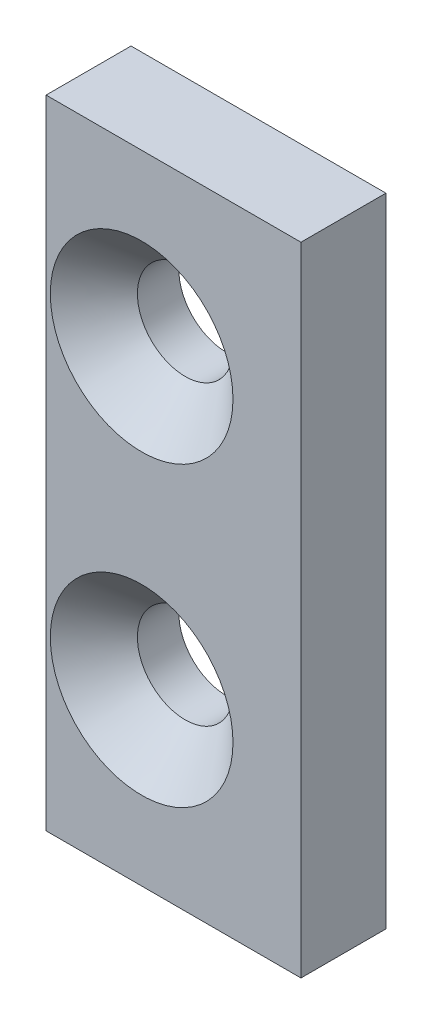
ISO-10303-21;
HEADER;
FILE_DESCRIPTION(('STEP AP214'),'2;1');
FILE_NAME('part.step','',(''),(''),'','','');
FILE_SCHEMA(('AUTOMOTIVE_DESIGN { 1 0 10303 214 1 1 1 1 }'));
ENDSEC;
DATA;
#1=APPLICATION_CONTEXT('core data for automotive mechanical design processes');
#2=APPLICATION_PROTOCOL_DEFINITION('international standard','automotive_design',2000,#1);
#3=PRODUCT_CONTEXT('',#1,'mechanical');
#4=PRODUCT('Part','Part','',(#3));
#5=PRODUCT_RELATED_PRODUCT_CATEGORY('part','',(#4));
#6=PRODUCT_DEFINITION_FORMATION('','',#4);
#7=PRODUCT_DEFINITION_CONTEXT('part definition',#1,'design');
#8=PRODUCT_DEFINITION('design','',#6,#7);
#9=PRODUCT_DEFINITION_SHAPE('','',#8);
#10=(LENGTH_UNIT() NAMED_UNIT(*) SI_UNIT(.MILLI.,.METRE.));
#11=(NAMED_UNIT(*) PLANE_ANGLE_UNIT() SI_UNIT($,.RADIAN.));
#12=(NAMED_UNIT(*) SI_UNIT($,.STERADIAN.) SOLID_ANGLE_UNIT());
#13=UNCERTAINTY_MEASURE_WITH_UNIT(LENGTH_MEASURE(1.E-05),#10,'distance_accuracy_value','');
#14=(GEOMETRIC_REPRESENTATION_CONTEXT(3) GLOBAL_UNCERTAINTY_ASSIGNED_CONTEXT((#13)) GLOBAL_UNIT_ASSIGNED_CONTEXT((#10,
#11,#12)) REPRESENTATION_CONTEXT('',''));
#15=CARTESIAN_POINT('',(0.,0.,0.));
#16=DIRECTION('',(0.,0.,1.));
#17=DIRECTION('',(1.,0.,0.));
#18=AXIS2_PLACEMENT_3D('',#15,#16,#17);
#19=CARTESIAN_POINT('',(100.,-18.670608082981,4.));
#20=DIRECTION('',(1.,0.,0.));
#21=DIRECTION('',(0.,0.,-1.));
#22=AXIS2_PLACEMENT_3D('',#19,#20,#21);
#23=PLANE('',#22);
#24=DIRECTION('',(0.,-1.,0.));
#25=VECTOR('',#24,1.);
#26=CARTESIAN_POINT('',(100.,-18.670608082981,0.));
#27=LINE('',#26,#25);
#28=CARTESIAN_POINT('',(100.,11.329391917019,0.));
#29=VERTEX_POINT('',#28);
#30=CARTESIAN_POINT('',(100.,-18.670608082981,0.));
#31=VERTEX_POINT('',#30);
#32=EDGE_CURVE('E79',#29,#31,#27,.T.);
#33=ORIENTED_EDGE('',*,*,#32,.T.);
#34=DIRECTION('',(0.,0.,-1.));
#35=VECTOR('',#34,1.);
#36=CARTESIAN_POINT('',(100.,-18.670608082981,4.));
#37=LINE('',#36,#35);
#38=CARTESIAN_POINT('',(100.,-18.670608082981,4.));
#39=VERTEX_POINT('',#38);
#40=EDGE_CURVE('E11',#39,#31,#37,.T.);
#41=ORIENTED_EDGE('',*,*,#40,.F.);
#42=DIRECTION('',(0.,-1.,0.));
#43=VECTOR('',#42,1.);
#44=CARTESIAN_POINT('',(100.,-18.670608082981,4.));
#45=LINE('',#44,#43);
#46=CARTESIAN_POINT('',(100.,11.329391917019,4.));
#47=VERTEX_POINT('',#46);
#48=EDGE_CURVE('E67',#47,#39,#45,.T.);
#49=ORIENTED_EDGE('',*,*,#48,.F.);
#50=DIRECTION('',(0.,0.,-1.));
#51=VECTOR('',#50,1.);
#52=CARTESIAN_POINT('',(100.,11.329391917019,4.));
#53=LINE('',#52,#51);
#54=EDGE_CURVE('E75',#47,#29,#53,.T.);
#55=ORIENTED_EDGE('',*,*,#54,.T.);
#56=EDGE_LOOP('',(#33,#41,#49,#55));
#57=FACE_BOUND('',#56,.T.);
#58=ADVANCED_FACE('F16',(#57),#23,.F.);
#59=CARTESIAN_POINT('',(100.,-18.670608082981,4.));
#60=DIRECTION('',(0.,1.,0.));
#61=DIRECTION('',(0.,0.,1.));
#62=AXIS2_PLACEMENT_3D('',#59,#60,#61);
#63=PLANE('',#62);
#64=DIRECTION('',(1.,0.,0.));
#65=VECTOR('',#64,1.);
#66=CARTESIAN_POINT('',(100.,-18.670608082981,0.));
#67=LINE('',#66,#65);
#68=CARTESIAN_POINT('',(112.,-18.670608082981,0.));
#69=VERTEX_POINT('',#68);
#70=EDGE_CURVE('E71',#31,#69,#67,.T.);
#71=ORIENTED_EDGE('',*,*,#70,.T.);
#72=DIRECTION('',(0.,0.,-1.));
#73=VECTOR('',#72,1.);
#74=CARTESIAN_POINT('',(112.,-18.670608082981,4.));
#75=LINE('',#74,#73);
#76=CARTESIAN_POINT('',(112.,-18.670608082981,4.));
#77=VERTEX_POINT('',#76);
#78=EDGE_CURVE('E24',#77,#69,#75,.T.);
#79=ORIENTED_EDGE('',*,*,#78,.F.);
#80=DIRECTION('',(1.,0.,0.));
#81=VECTOR('',#80,1.);
#82=CARTESIAN_POINT('',(100.,-18.670608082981,4.));
#83=LINE('',#82,#81);
#84=EDGE_CURVE('E62',#39,#77,#83,.T.);
#85=ORIENTED_EDGE('',*,*,#84,.F.);
#86=ORIENTED_EDGE('',*,*,#40,.T.);
#87=EDGE_LOOP('',(#71,#79,#85,#86));
#88=FACE_BOUND('',#87,.T.);
#89=ADVANCED_FACE('F70',(#88),#63,.F.);
#90=CARTESIAN_POINT('',(112.,-18.670608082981,4.));
#91=DIRECTION('',(-1.,0.,0.));
#92=DIRECTION('',(0.,0.,1.));
#93=AXIS2_PLACEMENT_3D('',#90,#91,#92);
#94=PLANE('',#93);
#95=DIRECTION('',(0.,1.,0.));
#96=VECTOR('',#95,1.);
#97=CARTESIAN_POINT('',(112.,-18.670608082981,0.));
#98=LINE('',#97,#96);
#99=CARTESIAN_POINT('',(112.,11.329391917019,0.));
#100=VERTEX_POINT('',#99);
#101=EDGE_CURVE('E49',#69,#100,#98,.T.);
#102=ORIENTED_EDGE('',*,*,#101,.T.);
#103=DIRECTION('',(0.,0.,-1.));
#104=VECTOR('',#103,1.);
#105=CARTESIAN_POINT('',(112.,11.329391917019,4.));
#106=LINE('',#105,#104);
#107=CARTESIAN_POINT('',(112.,11.329391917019,4.));
#108=VERTEX_POINT('',#107);
#109=EDGE_CURVE('E72',#108,#100,#106,.T.);
#110=ORIENTED_EDGE('',*,*,#109,.F.);
#111=DIRECTION('',(0.,1.,0.));
#112=VECTOR('',#111,1.);
#113=CARTESIAN_POINT('',(112.,-18.670608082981,4.));
#114=LINE('',#113,#112);
#115=EDGE_CURVE('E65',#77,#108,#114,.T.);
#116=ORIENTED_EDGE('',*,*,#115,.F.);
#117=ORIENTED_EDGE('',*,*,#78,.T.);
#118=EDGE_LOOP('',(#102,#110,#116,#117));
#119=FACE_BOUND('',#118,.T.);
#120=ADVANCED_FACE('F73',(#119),#94,.F.);
#121=CARTESIAN_POINT('',(100.,11.329391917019,4.));
#122=DIRECTION('',(0.,-1.,0.));
#123=DIRECTION('',(0.,0.,-1.));
#124=AXIS2_PLACEMENT_3D('',#121,#122,#123);
#125=PLANE('',#124);
#126=DIRECTION('',(-1.,0.,0.));
#127=VECTOR('',#126,1.);
#128=CARTESIAN_POINT('',(100.,11.329391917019,0.));
#129=LINE('',#128,#127);
#130=EDGE_CURVE('E55',#100,#29,#129,.T.);
#131=ORIENTED_EDGE('',*,*,#130,.T.);
#132=ORIENTED_EDGE('',*,*,#54,.F.);
#133=DIRECTION('',(-1.,0.,0.));
#134=VECTOR('',#133,1.);
#135=CARTESIAN_POINT('',(100.,11.329391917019,4.));
#136=LINE('',#135,#134);
#137=EDGE_CURVE('E32',#108,#47,#136,.T.);
#138=ORIENTED_EDGE('',*,*,#137,.F.);
#139=ORIENTED_EDGE('',*,*,#109,.T.);
#140=EDGE_LOOP('',(#131,#132,#138,#139));
#141=FACE_BOUND('',#140,.T.);
#142=ADVANCED_FACE('F87',(#141),#125,.F.);
#143=CARTESIAN_POINT('',(0.,0.,4.));
#144=DIRECTION('',(0.,0.,-1.));
#145=DIRECTION('',(-1.,0.,0.));
#146=AXIS2_PLACEMENT_3D('',#143,#144,#145);
#147=PLANE('',#146);
#148=CARTESIAN_POINT('',(104.5,3.32939191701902,4.));
#149=DIRECTION('',(0.,0.,1.));
#150=DIRECTION('',(1.,0.,0.));
#151=AXIS2_PLACEMENT_3D('',#148,#149,#150);
#152=CIRCLE('',#151,4.3);
#153=CARTESIAN_POINT('',(108.8,3.32939191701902,4.));
#154=VERTEX_POINT('',#153);
#155=EDGE_CURVE('E107',#154,#154,#152,.T.);
#156=ORIENTED_EDGE('',*,*,#155,.F.);
#157=EDGE_LOOP('',(#156));
#158=FACE_BOUND('',#157,.T.);
#159=CARTESIAN_POINT('',(104.5,-10.670608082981,4.));
#160=DIRECTION('',(0.,0.,1.));
#161=DIRECTION('',(1.,0.,0.));
#162=AXIS2_PLACEMENT_3D('',#159,#160,#161);
#163=CIRCLE('',#162,4.3);
#164=CARTESIAN_POINT('',(108.8,-10.670608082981,4.));
#165=VERTEX_POINT('',#164);
#166=EDGE_CURVE('E98',#165,#165,#163,.T.);
#167=ORIENTED_EDGE('',*,*,#166,.F.);
#168=EDGE_LOOP('',(#167));
#169=FACE_BOUND('',#168,.T.);
#170=ORIENTED_EDGE('',*,*,#48,.T.);
#171=ORIENTED_EDGE('',*,*,#84,.T.);
#172=ORIENTED_EDGE('',*,*,#115,.T.);
#173=ORIENTED_EDGE('',*,*,#137,.T.);
#174=EDGE_LOOP('',(#170,#171,#172,#173));
#175=FACE_BOUND('',#174,.T.);
#176=ADVANCED_FACE('F63',(#158,#169,#175),#147,.F.);
#177=CARTESIAN_POINT('',(0.,0.,0.));
#178=DIRECTION('',(0.,0.,-1.));
#179=DIRECTION('',(-1.,0.,0.));
#180=AXIS2_PLACEMENT_3D('',#177,#178,#179);
#181=PLANE('',#180);
#182=CARTESIAN_POINT('',(104.5,3.32939191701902,0.));
#183=DIRECTION('',(0.,0.,1.));
#184=DIRECTION('',(1.,0.,0.));
#185=AXIS2_PLACEMENT_3D('',#182,#183,#184);
#186=CIRCLE('',#185,2.25);
#187=CARTESIAN_POINT('',(106.75,3.32939191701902,0.));
#188=VERTEX_POINT('',#187);
#189=EDGE_CURVE('E101',#188,#188,#186,.T.);
#190=ORIENTED_EDGE('',*,*,#189,.T.);
#191=EDGE_LOOP('',(#190));
#192=FACE_BOUND('',#191,.T.);
#193=CARTESIAN_POINT('',(104.5,-10.670608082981,0.));
#194=DIRECTION('',(0.,0.,1.));
#195=DIRECTION('',(1.,0.,0.));
#196=AXIS2_PLACEMENT_3D('',#193,#194,#195);
#197=CIRCLE('',#196,2.25);
#198=CARTESIAN_POINT('',(106.75,-10.670608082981,0.));
#199=VERTEX_POINT('',#198);
#200=EDGE_CURVE('E82',#199,#199,#197,.T.);
#201=ORIENTED_EDGE('',*,*,#200,.T.);
#202=EDGE_LOOP('',(#201));
#203=FACE_BOUND('',#202,.T.);
#204=ORIENTED_EDGE('',*,*,#32,.F.);
#205=ORIENTED_EDGE('',*,*,#130,.F.);
#206=ORIENTED_EDGE('',*,*,#101,.F.);
#207=ORIENTED_EDGE('',*,*,#70,.F.);
#208=EDGE_LOOP('',(#204,#205,#206,#207));
#209=FACE_BOUND('',#208,.T.);
#210=ADVANCED_FACE('F90',(#192,#203,#209),#181,.T.);
#211=CARTESIAN_POINT('',(104.5,-10.670608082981,4.));
#212=DIRECTION('',(0.,0.,1.));
#213=DIRECTION('',(1.,0.,0.));
#214=AXIS2_PLACEMENT_3D('',#211,#212,#213);
#215=CYLINDRICAL_SURFACE('',#214,2.25);
#216=ORIENTED_EDGE('',*,*,#200,.F.);
#217=EDGE_LOOP('',(#216));
#218=FACE_BOUND('',#217,.T.);
#219=CARTESIAN_POINT('',(104.5,-10.670608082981,1.95));
#220=DIRECTION('',(0.,0.,1.));
#221=DIRECTION('',(1.,0.,0.));
#222=AXIS2_PLACEMENT_3D('',#219,#220,#221);
#223=CIRCLE('',#222,2.25);
#224=CARTESIAN_POINT('',(106.75,-10.670608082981,1.95));
#225=VERTEX_POINT('',#224);
#226=EDGE_CURVE('E95',#225,#225,#223,.T.);
#227=ORIENTED_EDGE('',*,*,#226,.T.);
#228=EDGE_LOOP('',(#227));
#229=FACE_BOUND('',#228,.T.);
#230=ADVANCED_FACE('F121',(#218,#229),#215,.F.);
#231=CARTESIAN_POINT('',(104.5,-10.670608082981,4.));
#232=DIRECTION('',(0.,0.,1.));
#233=DIRECTION('',(1.,0.,0.));
#234=AXIS2_PLACEMENT_3D('',#231,#232,#233);
#235=CONICAL_SURFACE('',#234,4.3,0.785398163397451);
#236=ORIENTED_EDGE('',*,*,#226,.F.);
#237=EDGE_LOOP('',(#236));
#238=FACE_BOUND('',#237,.T.);
#239=ORIENTED_EDGE('',*,*,#166,.T.);
#240=EDGE_LOOP('',(#239));
#241=FACE_BOUND('',#240,.T.);
#242=ADVANCED_FACE('F118',(#238,#241),#235,.F.);
#243=CARTESIAN_POINT('',(104.5,3.32939191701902,4.));
#244=DIRECTION('',(0.,0.,1.));
#245=DIRECTION('',(1.,0.,0.));
#246=AXIS2_PLACEMENT_3D('',#243,#244,#245);
#247=CYLINDRICAL_SURFACE('',#246,2.25);
#248=ORIENTED_EDGE('',*,*,#189,.F.);
#249=EDGE_LOOP('',(#248));
#250=FACE_BOUND('',#249,.T.);
#251=CARTESIAN_POINT('',(104.5,3.32939191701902,1.95));
#252=DIRECTION('',(0.,0.,1.));
#253=DIRECTION('',(1.,0.,0.));
#254=AXIS2_PLACEMENT_3D('',#251,#252,#253);
#255=CIRCLE('',#254,2.25);
#256=CARTESIAN_POINT('',(106.75,3.32939191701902,1.95));
#257=VERTEX_POINT('',#256);
#258=EDGE_CURVE('E104',#257,#257,#255,.T.);
#259=ORIENTED_EDGE('',*,*,#258,.T.);
#260=EDGE_LOOP('',(#259));
#261=FACE_BOUND('',#260,.T.);
#262=ADVANCED_FACE('F120',(#250,#261),#247,.F.);
#263=CARTESIAN_POINT('',(104.5,3.32939191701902,4.));
#264=DIRECTION('',(0.,0.,1.));
#265=DIRECTION('',(1.,0.,0.));
#266=AXIS2_PLACEMENT_3D('',#263,#264,#265);
#267=CONICAL_SURFACE('',#266,4.3,0.785398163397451);
#268=ORIENTED_EDGE('',*,*,#258,.F.);
#269=EDGE_LOOP('',(#268));
#270=FACE_BOUND('',#269,.T.);
#271=ORIENTED_EDGE('',*,*,#155,.T.);
#272=EDGE_LOOP('',(#271));
#273=FACE_BOUND('',#272,.T.);
#274=ADVANCED_FACE('F111',(#270,#273),#267,.F.);
#275=CLOSED_SHELL('',(#58,#89,#120,#142,#176,#210,#230,#242,#262,#274));
#276=MANIFOLD_SOLID_BREP('B1',#275);
#277=ADVANCED_BREP_SHAPE_REPRESENTATION('',(#18,#276),#14);
#278=SHAPE_DEFINITION_REPRESENTATION(#9,#277);
ENDSEC;
END-ISO-10303-21;
